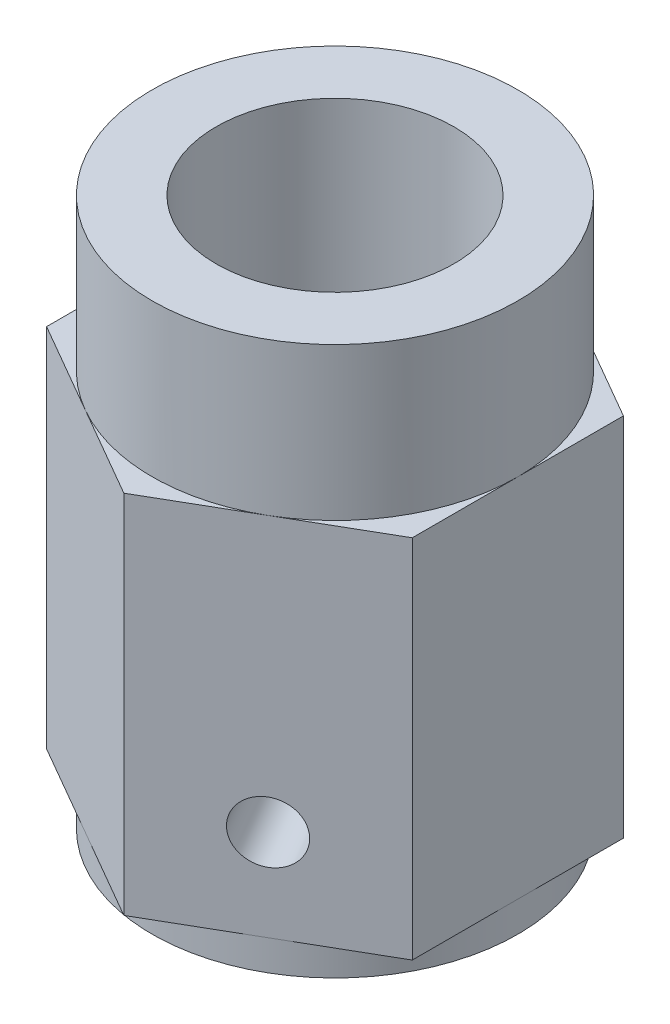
from build123d import *

# Parameters (mm, degrees)
EXTRUDE_1_DEPTH          = 60
SKETCH_2_R               = 30
EXTRUDE_2_DEPTH          = 25
EXTRUDE_START            = 5
SKETCH_3_R               = 30
EXTRUDE_3_DEPTH          = 5
SKETCH_4_R               = 15
CUT_EXTRUDE_1_DEPTH      = 45
SKETCH_5_R               = 19.5
CUT_EXTRUDE_2_DEPTH      = 45
CUT_EXTRUDE_3_REACH      = 111.659
CUT_EXTRUDE_3_END_RADIUS = 15
SKETCH_6_R               = 5
CUT_EXTRUDE_4_REACH      = 115.688
CUT_EXTRUDE_4_END_RADIUS = 15
SKETCH_7_R               = 5
CUT_EXTRUDE_5_REACH      = 115.688
CUT_EXTRUDE_5_END_RADIUS = 15
SKETCH_8_R               = 5


with BuildPart() as part:
    # Sketch 1 → Extrude 1 (new body)
    with BuildSketch(Plane(origin=(0, 0, 0), x_dir=(1, 0, 0), z_dir=(0, 1, 0))):
        Polygon((0, 34.641016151), (-30, 17.320508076), (-30, -17.320508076), (0, -34.641016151), (30, -17.320508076), (30, 17.320508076), align=None)
    extrude(amount=EXTRUDE_1_DEPTH)

    # Sketch 2 → Extrude 2 (add)
    with BuildSketch(Plane(origin=(0, 60, 0), x_dir=(1, 0, 0), z_dir=(0, 1, 0))):
        with Locations(Location((0, 0, 0), (0, 0, 60))):
            Circle(SKETCH_2_R)
    extrude(amount=EXTRUDE_2_DEPTH)

    # Sketch 3 → Extrude 3 (add)
    with BuildSketch(Plane.XZ.offset(EXTRUDE_START)):
        with Locations(Location((0, 0, 0), (0, 0, 300))):
            Circle(SKETCH_3_R)
    extrude(amount=-EXTRUDE_3_DEPTH)

    # Sketch 4 → Cut-Extrude 1 (cut)
    with BuildSketch(Plane.XZ.offset(5)):
        with Locations(Location((0, 0, 0), (0, 0, 270))):
            Circle(SKETCH_4_R)
    extrude(amount=-CUT_EXTRUDE_1_DEPTH, mode=Mode.SUBTRACT)

    # Sketch 5 → Cut-Extrude 2 (cut)
    with BuildSketch(Plane(origin=(0, 85, 0), x_dir=(1, 0, 0), z_dir=(0, 1, 0))):
        with Locations(Location((0, 0, 0), (0, 0, 270))):
            Circle(SKETCH_5_R)
    extrude(amount=-CUT_EXTRUDE_2_DEPTH, mode=Mode.SUBTRACT)

    # Cut-Extrude 3: up to this cylinder (the profile starts outside it)
    cut_extrude_3_end = Plane(origin=(0, 15, 0), z_dir=(0, -1, 0)) * Cylinder(CUT_EXTRUDE_3_END_RADIUS, 254.318, mode=Mode.PRIVATE)
    # Sketch 6 → Cut-Extrude 3 (cut, up to the surface)
    with BuildSketch(Plane.ZY.offset(30), mode=Mode.PRIVATE) as cut_extrude_3_sk1:
        with Locations((0, 15)):
            Circle(SKETCH_6_R)
    cut_extrude_3_tool1 = extrude(cut_extrude_3_sk1.sketch, amount=-CUT_EXTRUDE_3_REACH, mode=Mode.PRIVATE) - cut_extrude_3_end
    add(cut_extrude_3_tool1.solids().sort_by_distance((-30, 15, 0))[0], mode=Mode.SUBTRACT)

    # Cut-Extrude 4: up to this cylinder (the profile starts outside it)
    cut_extrude_4_end = Plane(origin=(0, 15, 0), z_dir=(0, -1, 0)) * Cylinder(CUT_EXTRUDE_4_END_RADIUS, 262.376, mode=Mode.PRIVATE)
    # Sketch 7 → Cut-Extrude 4 (cut, up to the surface)
    with BuildSketch(Plane(origin=(15, 0, 25.980762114), x_dir=(0.8660254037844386, 0, -0.5000000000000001), z_dir=(0.5000000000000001, 0, 0.8660254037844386)), mode=Mode.PRIVATE) as cut_extrude_4_sk1:
        with Locations((0, 15)):
            Circle(SKETCH_7_R)
    cut_extrude_4_tool1 = extrude(cut_extrude_4_sk1.sketch, amount=-CUT_EXTRUDE_4_REACH, mode=Mode.PRIVATE) - cut_extrude_4_end
    add(cut_extrude_4_tool1.solids().sort_by_distance((15, 15, 25.980762))[0], mode=Mode.SUBTRACT)

    # Cut-Extrude 5: up to this cylinder (the profile starts outside it)
    cut_extrude_5_end = Plane(origin=(0, 15, 0), z_dir=(0, -1, 0)) * Cylinder(CUT_EXTRUDE_5_END_RADIUS, 262.376, mode=Mode.PRIVATE)
    # Sketch 8 → Cut-Extrude 5 (cut, up to the surface)
    with BuildSketch(Plane(origin=(15, 0, -25.980762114), x_dir=(-0.8660254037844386, 0, -0.5000000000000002), z_dir=(0.5000000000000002, 0, -0.8660254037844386)), mode=Mode.PRIVATE) as cut_extrude_5_sk1:
        with Locations((0, 15)):
            Circle(SKETCH_8_R)
    cut_extrude_5_tool1 = extrude(cut_extrude_5_sk1.sketch, amount=-CUT_EXTRUDE_5_REACH, mode=Mode.PRIVATE) - cut_extrude_5_end
    add(cut_extrude_5_tool1.solids().sort_by_distance((15, 15, -25.980762))[0], mode=Mode.SUBTRACT)


solid = part.part
